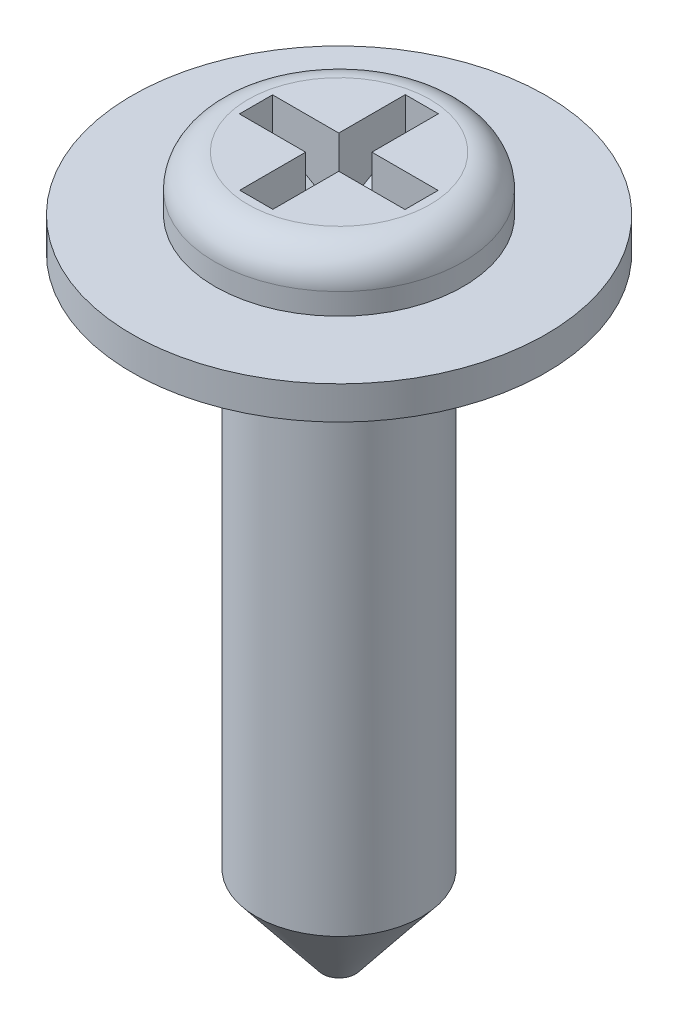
ISO-10303-21;
HEADER;
FILE_DESCRIPTION(('STEP AP214'),'2;1');
FILE_NAME('part.step','',(''),(''),'','','');
FILE_SCHEMA(('AUTOMOTIVE_DESIGN { 1 0 10303 214 1 1 1 1 }'));
ENDSEC;
DATA;
#1=APPLICATION_CONTEXT('core data for automotive mechanical design processes');
#2=APPLICATION_PROTOCOL_DEFINITION('international standard','automotive_design',2000,#1);
#3=PRODUCT_CONTEXT('',#1,'mechanical');
#4=PRODUCT('Part','Part','',(#3));
#5=PRODUCT_RELATED_PRODUCT_CATEGORY('part','',(#4));
#6=PRODUCT_DEFINITION_FORMATION('','',#4);
#7=PRODUCT_DEFINITION_CONTEXT('part definition',#1,'design');
#8=PRODUCT_DEFINITION('design','',#6,#7);
#9=PRODUCT_DEFINITION_SHAPE('','',#8);
#10=(LENGTH_UNIT() NAMED_UNIT(*) SI_UNIT(.MILLI.,.METRE.));
#11=(NAMED_UNIT(*) PLANE_ANGLE_UNIT() SI_UNIT($,.RADIAN.));
#12=(NAMED_UNIT(*) SI_UNIT($,.STERADIAN.) SOLID_ANGLE_UNIT());
#13=UNCERTAINTY_MEASURE_WITH_UNIT(LENGTH_MEASURE(1.E-05),#10,'distance_accuracy_value','');
#14=(GEOMETRIC_REPRESENTATION_CONTEXT(3) GLOBAL_UNCERTAINTY_ASSIGNED_CONTEXT((#13)) GLOBAL_UNIT_ASSIGNED_CONTEXT((#10,
#11,#12)) REPRESENTATION_CONTEXT('',''));
#15=CARTESIAN_POINT('',(0.,0.,0.));
#16=DIRECTION('',(0.,0.,1.));
#17=DIRECTION('',(1.,0.,0.));
#18=AXIS2_PLACEMENT_3D('',#15,#16,#17);
#19=CARTESIAN_POINT('',(0.,-8.5,0.));
#20=DIRECTION('',(0.,-1.,0.));
#21=DIRECTION('',(0.,0.,-1.));
#22=AXIS2_PLACEMENT_3D('',#19,#20,#21);
#23=CYLINDRICAL_SURFACE('',#22,2.5);
#24=CARTESIAN_POINT('',(0.,-0.658040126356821,0.));
#25=DIRECTION('',(0.,-1.,0.));
#26=DIRECTION('',(0.,0.,-1.));
#27=AXIS2_PLACEMENT_3D('',#24,#25,#26);
#28=CIRCLE('',#27,2.5);
#29=CARTESIAN_POINT('',(0.,-0.658040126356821,-2.5));
#30=VERTEX_POINT('',#29);
#31=EDGE_CURVE('E308',#30,#30,#28,.T.);
#32=ORIENTED_EDGE('',*,*,#31,.T.);
#33=EDGE_LOOP('',(#32));
#34=FACE_BOUND('',#33,.T.);
#35=CARTESIAN_POINT('',(0.,-1.05804012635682,0.));
#36=DIRECTION('',(0.,-1.,0.));
#37=DIRECTION('',(0.,0.,-1.));
#38=AXIS2_PLACEMENT_3D('',#35,#36,#37);
#39=CIRCLE('',#38,2.5);
#40=CARTESIAN_POINT('',(0.,-1.05804012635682,-2.5));
#41=VERTEX_POINT('',#40);
#42=EDGE_CURVE('E252',#41,#41,#39,.T.);
#43=ORIENTED_EDGE('',*,*,#42,.F.);
#44=EDGE_LOOP('',(#43));
#45=FACE_BOUND('',#44,.T.);
#46=ADVANCED_FACE('F39',(#34,#45),#23,.T.);
#47=CARTESIAN_POINT('',(1.5,-0.658040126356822,0.));
#48=DIRECTION('',(0.,1.,0.));
#49=DIRECTION('',(0.,0.,1.));
#50=AXIS2_PLACEMENT_3D('',#47,#48,#49);
#51=PLANE('',#50);
#52=CARTESIAN_POINT('',(0.,-0.658040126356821,0.));
#53=DIRECTION('',(0.,-1.,0.));
#54=DIRECTION('',(0.,0.,-1.));
#55=AXIS2_PLACEMENT_3D('',#52,#53,#54);
#56=CIRCLE('',#55,1.5);
#57=CARTESIAN_POINT('',(0.,-0.658040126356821,-1.5));
#58=VERTEX_POINT('',#57);
#59=EDGE_CURVE('E304',#58,#58,#56,.T.);
#60=ORIENTED_EDGE('',*,*,#59,.T.);
#61=EDGE_LOOP('',(#60));
#62=FACE_BOUND('',#61,.T.);
#63=ORIENTED_EDGE('',*,*,#31,.F.);
#64=EDGE_LOOP('',(#63));
#65=FACE_BOUND('',#64,.T.);
#66=ADVANCED_FACE('F412',(#62,#65),#51,.T.);
#67=CARTESIAN_POINT('',(0.,-8.5,0.));
#68=DIRECTION('',(0.,-1.,0.));
#69=DIRECTION('',(0.,0.,-1.));
#70=AXIS2_PLACEMENT_3D('',#67,#68,#69);
#71=CYLINDRICAL_SURFACE('',#70,1.5);
#72=CARTESIAN_POINT('',(0.,-0.399999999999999,0.));
#73=DIRECTION('',(0.,-1.,0.));
#74=DIRECTION('',(0.,0.,-1.));
#75=AXIS2_PLACEMENT_3D('',#72,#73,#74);
#76=CIRCLE('',#75,1.5);
#77=CARTESIAN_POINT('',(0.,-0.399999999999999,-1.5));
#78=VERTEX_POINT('',#77);
#79=EDGE_CURVE('E300',#78,#78,#76,.T.);
#80=ORIENTED_EDGE('',*,*,#79,.T.);
#81=EDGE_LOOP('',(#80));
#82=FACE_BOUND('',#81,.T.);
#83=ORIENTED_EDGE('',*,*,#59,.F.);
#84=EDGE_LOOP('',(#83));
#85=FACE_BOUND('',#84,.T.);
#86=ADVANCED_FACE('F418',(#82,#85),#71,.T.);
#87=CARTESIAN_POINT('',(0.,-0.4,0.));
#88=DIRECTION('',(0.,-1.,0.));
#89=DIRECTION('',(0.,0.,-1.));
#90=AXIS2_PLACEMENT_3D('',#87,#88,#89);
#91=TOROIDAL_SURFACE('',#90,1.1,0.4);
#92=CARTESIAN_POINT('',(0.,0.,0.));
#93=DIRECTION('',(0.,-1.,0.));
#94=DIRECTION('',(0.,0.,-1.));
#95=AXIS2_PLACEMENT_3D('',#92,#93,#94);
#96=CIRCLE('',#95,1.1);
#97=CARTESIAN_POINT('',(0.,0.,-1.1));
#98=VERTEX_POINT('',#97);
#99=EDGE_CURVE('E296',#98,#98,#96,.T.);
#100=ORIENTED_EDGE('',*,*,#99,.T.);
#101=EDGE_LOOP('',(#100));
#102=FACE_BOUND('',#101,.T.);
#103=ORIENTED_EDGE('',*,*,#79,.F.);
#104=EDGE_LOOP('',(#103));
#105=FACE_BOUND('',#104,.T.);
#106=ADVANCED_FACE('F586',(#102,#105),#91,.T.);
#107=CARTESIAN_POINT('',(0.,0.,0.));
#108=DIRECTION('',(0.,1.,0.));
#109=DIRECTION('',(0.,0.,1.));
#110=AXIS2_PLACEMENT_3D('',#107,#108,#109);
#111=PLANE('',#110);
#112=DIRECTION('',(0.,0.,1.));
#113=VECTOR('',#112,1.);
#114=CARTESIAN_POINT('',(-1.,0.,-0.196419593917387));
#115=LINE('',#114,#113);
#116=CARTESIAN_POINT('',(-1.,0.,-0.196419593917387));
#117=VERTEX_POINT('',#116);
#118=CARTESIAN_POINT('',(-1.,0.,0.203580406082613));
#119=VERTEX_POINT('',#118);
#120=EDGE_CURVE('E205',#117,#119,#115,.T.);
#121=ORIENTED_EDGE('',*,*,#120,.F.);
#122=DIRECTION('',(-1.,0.,0.));
#123=VECTOR('',#122,1.);
#124=CARTESIAN_POINT('',(-1.,0.,-0.196419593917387));
#125=LINE('',#124,#123);
#126=CARTESIAN_POINT('',(-0.2,0.,-0.196419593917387));
#127=VERTEX_POINT('',#126);
#128=EDGE_CURVE('E164',#127,#117,#125,.T.);
#129=ORIENTED_EDGE('',*,*,#128,.F.);
#130=DIRECTION('',(0.,0.,1.));
#131=VECTOR('',#130,1.);
#132=CARTESIAN_POINT('',(-0.2,0.,-1.));
#133=LINE('',#132,#131);
#134=CARTESIAN_POINT('',(-0.2,0.,-1.));
#135=VERTEX_POINT('',#134);
#136=EDGE_CURVE('E242',#135,#127,#133,.T.);
#137=ORIENTED_EDGE('',*,*,#136,.F.);
#138=DIRECTION('',(-1.,0.,0.));
#139=VECTOR('',#138,1.);
#140=CARTESIAN_POINT('',(-0.2,0.,-1.));
#141=LINE('',#140,#139);
#142=CARTESIAN_POINT('',(0.2,0.,-1.));
#143=VERTEX_POINT('',#142);
#144=EDGE_CURVE('E238',#143,#135,#141,.T.);
#145=ORIENTED_EDGE('',*,*,#144,.F.);
#146=DIRECTION('',(0.,0.,-1.));
#147=VECTOR('',#146,1.);
#148=CARTESIAN_POINT('',(0.2,0.,-1.));
#149=LINE('',#148,#147);
#150=CARTESIAN_POINT('',(0.2,0.,-0.196419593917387));
#151=VERTEX_POINT('',#150);
#152=EDGE_CURVE('E234',#151,#143,#149,.T.);
#153=ORIENTED_EDGE('',*,*,#152,.F.);
#154=DIRECTION('',(-1.,0.,0.));
#155=VECTOR('',#154,1.);
#156=CARTESIAN_POINT('',(0.2,0.,-0.196419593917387));
#157=LINE('',#156,#155);
#158=CARTESIAN_POINT('',(1.,0.,-0.196419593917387));
#159=VERTEX_POINT('',#158);
#160=EDGE_CURVE('E230',#159,#151,#157,.T.);
#161=ORIENTED_EDGE('',*,*,#160,.F.);
#162=DIRECTION('',(0.,0.,-1.));
#163=VECTOR('',#162,1.);
#164=CARTESIAN_POINT('',(1.,0.,-0.196419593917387));
#165=LINE('',#164,#163);
#166=CARTESIAN_POINT('',(1.,0.,0.203580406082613));
#167=VERTEX_POINT('',#166);
#168=EDGE_CURVE('E226',#167,#159,#165,.T.);
#169=ORIENTED_EDGE('',*,*,#168,.F.);
#170=DIRECTION('',(1.,0.,0.));
#171=VECTOR('',#170,1.);
#172=CARTESIAN_POINT('',(0.2,0.,0.203580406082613));
#173=LINE('',#172,#171);
#174=CARTESIAN_POINT('',(0.2,0.,0.203580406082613));
#175=VERTEX_POINT('',#174);
#176=EDGE_CURVE('E222',#175,#167,#173,.T.);
#177=ORIENTED_EDGE('',*,*,#176,.F.);
#178=DIRECTION('',(0.,0.,-1.));
#179=VECTOR('',#178,1.);
#180=CARTESIAN_POINT('',(0.2,0.,0.203580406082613));
#181=LINE('',#180,#179);
#182=CARTESIAN_POINT('',(0.2,0.,1.));
#183=VERTEX_POINT('',#182);
#184=EDGE_CURVE('E218',#183,#175,#181,.T.);
#185=ORIENTED_EDGE('',*,*,#184,.F.);
#186=DIRECTION('',(1.,0.,0.));
#187=VECTOR('',#186,1.);
#188=CARTESIAN_POINT('',(-0.2,0.,1.));
#189=LINE('',#188,#187);
#190=CARTESIAN_POINT('',(-0.2,0.,1.));
#191=VERTEX_POINT('',#190);
#192=EDGE_CURVE('E214',#191,#183,#189,.T.);
#193=ORIENTED_EDGE('',*,*,#192,.F.);
#194=DIRECTION('',(0.,0.,1.));
#195=VECTOR('',#194,1.);
#196=CARTESIAN_POINT('',(-0.2,0.,0.203580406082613));
#197=LINE('',#196,#195);
#198=CARTESIAN_POINT('',(-0.2,0.,0.203580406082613));
#199=VERTEX_POINT('',#198);
#200=EDGE_CURVE('E211',#199,#191,#197,.T.);
#201=ORIENTED_EDGE('',*,*,#200,.F.);
#202=DIRECTION('',(1.,0.,0.));
#203=VECTOR('',#202,1.);
#204=CARTESIAN_POINT('',(-1.,0.,0.203580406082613));
#205=LINE('',#204,#203);
#206=EDGE_CURVE('E170',#119,#199,#205,.T.);
#207=ORIENTED_EDGE('',*,*,#206,.F.);
#208=EDGE_LOOP('',(#121,#129,#137,#145,#153,#161,#169,#177,#185,#193,#201,#207));
#209=FACE_BOUND('',#208,.T.);
#210=ORIENTED_EDGE('',*,*,#99,.F.);
#211=EDGE_LOOP('',(#210));
#212=FACE_BOUND('',#211,.T.);
#213=ADVANCED_FACE('F376',(#209,#212),#111,.T.);
#214=CARTESIAN_POINT('',(0.200000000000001,-8.5,0.));
#215=DIRECTION('',(0.,-1.,0.));
#216=DIRECTION('',(0.,0.,-1.));
#217=AXIS2_PLACEMENT_3D('',#214,#215,#216);
#218=PLANE('',#217);
#219=CARTESIAN_POINT('',(0.,-8.5,0.));
#220=DIRECTION('',(0.,-1.,0.));
#221=DIRECTION('',(0.,0.,-1.));
#222=AXIS2_PLACEMENT_3D('',#219,#220,#221);
#223=CIRCLE('',#222,0.200000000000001);
#224=CARTESIAN_POINT('',(0.,-8.5,0.200000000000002));
#225=VERTEX_POINT('',#224);
#226=EDGE_CURVE('E292',#225,#225,#223,.T.);
#227=ORIENTED_EDGE('',*,*,#226,.T.);
#228=EDGE_LOOP('',(#227));
#229=FACE_BOUND('',#228,.T.);
#230=ADVANCED_FACE('F569',(#229),#218,.T.);
#231=CARTESIAN_POINT('',(0.,-8.5,0.));
#232=DIRECTION('',(0.,1.,0.));
#233=DIRECTION('',(0.,0.,1.));
#234=AXIS2_PLACEMENT_3D('',#231,#232,#233);
#235=CONICAL_SURFACE('',#234,0.200000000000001,0.674740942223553);
#236=CARTESIAN_POINT('',(0.,-7.5,0.));
#237=DIRECTION('',(0.,-1.,0.));
#238=DIRECTION('',(0.,0.,-1.));
#239=AXIS2_PLACEMENT_3D('',#236,#237,#238);
#240=CIRCLE('',#239,1.);
#241=CARTESIAN_POINT('',(0.,-7.5,1.));
#242=VERTEX_POINT('',#241);
#243=EDGE_CURVE('E288',#242,#242,#240,.T.);
#244=CARTESIAN_POINT('',(0.,-7.5,1.));
#245=CARTESIAN_POINT('',(0.,-7.51041666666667,0.991666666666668));
#246=CARTESIAN_POINT('',(0.,-7.52083333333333,0.983333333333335));
#247=CARTESIAN_POINT('',(0.,-7.54166666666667,0.966666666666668));
#248=CARTESIAN_POINT('',(0.,-7.55208333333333,0.958333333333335));
#249=CARTESIAN_POINT('',(0.,-7.57291666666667,0.941666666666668));
#250=CARTESIAN_POINT('',(0.,-7.58333333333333,0.933333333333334));
#251=CARTESIAN_POINT('',(0.,-7.60416666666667,0.916666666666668));
#252=CARTESIAN_POINT('',(0.,-7.61458333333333,0.908333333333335));
#253=CARTESIAN_POINT('',(0.,-7.63541666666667,0.891666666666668));
#254=CARTESIAN_POINT('',(0.,-7.64583333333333,0.883333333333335));
#255=CARTESIAN_POINT('',(0.,-7.66666666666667,0.866666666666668));
#256=CARTESIAN_POINT('',(0.,-7.67708333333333,0.858333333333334));
#257=CARTESIAN_POINT('',(0.,-7.69791666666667,0.841666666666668));
#258=CARTESIAN_POINT('',(0.,-7.70833333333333,0.833333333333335));
#259=CARTESIAN_POINT('',(0.,-7.72916666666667,0.816666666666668));
#260=CARTESIAN_POINT('',(0.,-7.73958333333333,0.808333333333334));
#261=CARTESIAN_POINT('',(0.,-7.76041666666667,0.791666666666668));
#262=CARTESIAN_POINT('',(0.,-7.77083333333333,0.783333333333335));
#263=CARTESIAN_POINT('',(0.,-7.79166666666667,0.766666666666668));
#264=CARTESIAN_POINT('',(0.,-7.80208333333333,0.758333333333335));
#265=CARTESIAN_POINT('',(0.,-7.82291666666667,0.741666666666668));
#266=CARTESIAN_POINT('',(0.,-7.83333333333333,0.733333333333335));
#267=CARTESIAN_POINT('',(0.,-7.85416666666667,0.716666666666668));
#268=CARTESIAN_POINT('',(0.,-7.86458333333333,0.708333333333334));
#269=CARTESIAN_POINT('',(0.,-7.88541666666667,0.691666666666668));
#270=CARTESIAN_POINT('',(0.,-7.89583333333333,0.683333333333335));
#271=CARTESIAN_POINT('',(0.,-7.91666666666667,0.666666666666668));
#272=CARTESIAN_POINT('',(0.,-7.92708333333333,0.658333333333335));
#273=CARTESIAN_POINT('',(0.,-7.94791666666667,0.641666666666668));
#274=CARTESIAN_POINT('',(0.,-7.95833333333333,0.633333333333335));
#275=CARTESIAN_POINT('',(0.,-7.97916666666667,0.616666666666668));
#276=CARTESIAN_POINT('',(0.,-7.98958333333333,0.608333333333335));
#277=CARTESIAN_POINT('',(0.,-8.01041666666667,0.591666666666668));
#278=CARTESIAN_POINT('',(0.,-8.02083333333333,0.583333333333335));
#279=CARTESIAN_POINT('',(0.,-8.04166666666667,0.566666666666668));
#280=CARTESIAN_POINT('',(0.,-8.05208333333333,0.558333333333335));
#281=CARTESIAN_POINT('',(0.,-8.07291666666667,0.541666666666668));
#282=CARTESIAN_POINT('',(0.,-8.08333333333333,0.533333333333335));
#283=CARTESIAN_POINT('',(0.,-8.10416666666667,0.516666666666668));
#284=CARTESIAN_POINT('',(0.,-8.11458333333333,0.508333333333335));
#285=CARTESIAN_POINT('',(0.,-8.13541666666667,0.491666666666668));
#286=CARTESIAN_POINT('',(0.,-8.14583333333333,0.483333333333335));
#287=CARTESIAN_POINT('',(0.,-8.16666666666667,0.466666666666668));
#288=CARTESIAN_POINT('',(0.,-8.17708333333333,0.458333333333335));
#289=CARTESIAN_POINT('',(0.,-8.19791666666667,0.441666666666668));
#290=CARTESIAN_POINT('',(0.,-8.20833333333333,0.433333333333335));
#291=CARTESIAN_POINT('',(0.,-8.22916666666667,0.416666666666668));
#292=CARTESIAN_POINT('',(0.,-8.23958333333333,0.408333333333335));
#293=CARTESIAN_POINT('',(0.,-8.26041666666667,0.391666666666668));
#294=CARTESIAN_POINT('',(0.,-8.27083333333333,0.383333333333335));
#295=CARTESIAN_POINT('',(0.,-8.29166666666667,0.366666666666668));
#296=CARTESIAN_POINT('',(0.,-8.30208333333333,0.358333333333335));
#297=CARTESIAN_POINT('',(0.,-8.32291666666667,0.341666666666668));
#298=CARTESIAN_POINT('',(0.,-8.33333333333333,0.333333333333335));
#299=CARTESIAN_POINT('',(0.,-8.35416666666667,0.316666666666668));
#300=CARTESIAN_POINT('',(0.,-8.36458333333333,0.308333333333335));
#301=CARTESIAN_POINT('',(0.,-8.38541666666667,0.291666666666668));
#302=CARTESIAN_POINT('',(0.,-8.39583333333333,0.283333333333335));
#303=CARTESIAN_POINT('',(0.,-8.41666666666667,0.266666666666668));
#304=CARTESIAN_POINT('',(0.,-8.42708333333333,0.258333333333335));
#305=CARTESIAN_POINT('',(0.,-8.44791666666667,0.241666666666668));
#306=CARTESIAN_POINT('',(0.,-8.45833333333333,0.233333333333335));
#307=CARTESIAN_POINT('',(0.,-8.47916666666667,0.216666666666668));
#308=CARTESIAN_POINT('',(0.,-8.48958333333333,0.208333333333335));
#309=CARTESIAN_POINT('',(0.,-8.5,0.200000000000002));
#310=B_SPLINE_CURVE_WITH_KNOTS('',3,(#244,#245,#246,#247,#248,#249,#250,#251,#252,#253,#254,
#255,#256,#257,#258,#259,#260,#261,#262,#263,#264,#265,#266,#267,#268,#269,#270,#271,#272,#273,
#274,#275,#276,#277,#278,#279,#280,#281,#282,#283,#284,#285,#286,#287,#288,#289,#290,#291,#292,
#293,#294,#295,#296,#297,#298,#299,#300,#301,#302,#303,#304,#305,#306,#307,#308,#309),
.UNSPECIFIED.,.F.,.F.,(4,2,2,2,2,2,2,2,2,2,2,2,2,2,2,2,2,2,2,2,2,2,2,2,2,2,2,2,2,2,2,2,4),(0.,
0.0400195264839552,0.0800390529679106,0.120058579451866,0.160078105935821,0.200097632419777,
0.240117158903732,0.280136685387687,0.320156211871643,0.360175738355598,0.400195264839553,
0.440214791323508,0.480234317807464,0.520253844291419,0.560273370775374,0.60029289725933,
0.640312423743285,0.68033195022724,0.720351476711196,0.760371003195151,0.800390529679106,
0.840410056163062,0.880429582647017,0.920449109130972,0.960468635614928,1.00048816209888,
1.04050768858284,1.08052721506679,1.12054674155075,1.1605662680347,1.20058579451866,
1.24060532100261,1.28062484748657),.UNSPECIFIED.);
#311=EDGE_CURVE('BSEAM560',#242,#225,#310,.T.);
#312=ORIENTED_EDGE('',*,*,#243,.T.);
#313=ORIENTED_EDGE('',*,*,#226,.F.);
#314=ORIENTED_EDGE('',*,*,#311,.T.);
#315=ORIENTED_EDGE('',*,*,#311,.F.);
#316=EDGE_LOOP('',(#312,#314,#313,#315));
#317=FACE_BOUND('',#316,.T.);
#318=ADVANCED_FACE('F560',(#317),#235,.T.);
#319=CARTESIAN_POINT('',(0.,-8.5,0.));
#320=DIRECTION('',(0.,-1.,0.));
#321=DIRECTION('',(0.,0.,-1.));
#322=AXIS2_PLACEMENT_3D('',#319,#320,#321);
#323=CYLINDRICAL_SURFACE('',#322,1.);
#324=CARTESIAN_POINT('',(0.,-1.05804012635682,0.));
#325=DIRECTION('',(0.,-1.,0.));
#326=DIRECTION('',(0.,0.,-1.));
#327=AXIS2_PLACEMENT_3D('',#324,#325,#326);
#328=CIRCLE('',#327,1.);
#329=CARTESIAN_POINT('',(0.,-1.05804012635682,-1.));
#330=VERTEX_POINT('',#329);
#331=EDGE_CURVE('E284',#330,#330,#328,.T.);
#332=ORIENTED_EDGE('',*,*,#331,.T.);
#333=EDGE_LOOP('',(#332));
#334=FACE_BOUND('',#333,.T.);
#335=ORIENTED_EDGE('',*,*,#243,.F.);
#336=EDGE_LOOP('',(#335));
#337=FACE_BOUND('',#336,.T.);
#338=ADVANCED_FACE('F551',(#334,#337),#323,.T.);
#339=CARTESIAN_POINT('',(1.,-1.05804012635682,0.));
#340=DIRECTION('',(0.,-1.,0.));
#341=DIRECTION('',(0.,0.,-1.));
#342=AXIS2_PLACEMENT_3D('',#339,#340,#341);
#343=PLANE('',#342);
#344=ORIENTED_EDGE('',*,*,#42,.T.);
#345=EDGE_LOOP('',(#344));
#346=FACE_BOUND('',#345,.T.);
#347=ORIENTED_EDGE('',*,*,#331,.F.);
#348=EDGE_LOOP('',(#347));
#349=FACE_BOUND('',#348,.T.);
#350=ADVANCED_FACE('F542',(#346,#349),#343,.T.);
#351=CARTESIAN_POINT('',(-1.,-0.8,-0.196419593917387));
#352=DIRECTION('',(-1.,0.,0.));
#353=DIRECTION('',(0.,0.,1.));
#354=AXIS2_PLACEMENT_3D('',#351,#352,#353);
#355=PLANE('',#354);
#356=DIRECTION('',(0.,1.,0.));
#357=VECTOR('',#356,1.);
#358=CARTESIAN_POINT('',(-1.,-0.8,0.203580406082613));
#359=LINE('',#358,#357);
#360=CARTESIAN_POINT('',(-1.,-0.4,0.203580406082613));
#361=VERTEX_POINT('',#360);
#362=EDGE_CURVE('E176',#361,#119,#359,.T.);
#363=ORIENTED_EDGE('',*,*,#362,.F.);
#364=DIRECTION('',(0.,0.,-1.));
#365=VECTOR('',#364,1.);
#366=CARTESIAN_POINT('',(-1.,-0.4,-0.196419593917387));
#367=LINE('',#366,#365);
#368=CARTESIAN_POINT('',(-1.,-0.4,-0.196419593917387));
#369=VERTEX_POINT('',#368);
#370=EDGE_CURVE('E328',#361,#369,#367,.T.);
#371=ORIENTED_EDGE('',*,*,#370,.T.);
#372=DIRECTION('',(0.,1.,0.));
#373=VECTOR('',#372,1.);
#374=CARTESIAN_POINT('',(-1.,-0.8,-0.196419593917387));
#375=LINE('',#374,#373);
#376=EDGE_CURVE('E249',#369,#117,#375,.T.);
#377=ORIENTED_EDGE('',*,*,#376,.T.);
#378=ORIENTED_EDGE('',*,*,#120,.T.);
#379=EDGE_LOOP('',(#363,#371,#377,#378));
#380=FACE_BOUND('',#379,.T.);
#381=ADVANCED_FACE('F388',(#380),#355,.F.);
#382=CARTESIAN_POINT('',(-1.,-0.8,-0.196419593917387));
#383=DIRECTION('',(0.,0.,-1.));
#384=DIRECTION('',(-1.,0.,0.));
#385=AXIS2_PLACEMENT_3D('',#382,#383,#384);
#386=PLANE('',#385);
#387=ORIENTED_EDGE('',*,*,#376,.F.);
#388=DIRECTION('',(0.866025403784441,-0.499999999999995,0.));
#389=VECTOR('',#388,1.);
#390=CARTESIAN_POINT('',(-0.30717967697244,-0.8,-0.196419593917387));
#391=LINE('',#390,#389);
#392=CARTESIAN_POINT('',(-0.30717967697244,-0.8,-0.196419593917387));
#393=VERTEX_POINT('',#392);
#394=EDGE_CURVE('E331',#369,#393,#391,.T.);
#395=ORIENTED_EDGE('',*,*,#394,.T.);
#396=DIRECTION('',(-1.,0.,0.));
#397=VECTOR('',#396,1.);
#398=CARTESIAN_POINT('',(-1.,-0.8,-0.196419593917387));
#399=LINE('',#398,#397);
#400=CARTESIAN_POINT('',(-0.2,-0.8,-0.196419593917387));
#401=VERTEX_POINT('',#400);
#402=EDGE_CURVE('E202',#401,#393,#399,.T.);
#403=ORIENTED_EDGE('',*,*,#402,.F.);
#404=DIRECTION('',(0.,1.,0.));
#405=VECTOR('',#404,1.);
#406=CARTESIAN_POINT('',(-0.2,-0.8,-0.196419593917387));
#407=LINE('',#406,#405);
#408=EDGE_CURVE('E253',#401,#127,#407,.T.);
#409=ORIENTED_EDGE('',*,*,#408,.T.);
#410=ORIENTED_EDGE('',*,*,#128,.T.);
#411=EDGE_LOOP('',(#387,#395,#403,#409,#410));
#412=FACE_BOUND('',#411,.T.);
#413=ADVANCED_FACE('F381',(#412),#386,.F.);
#414=CARTESIAN_POINT('',(-0.2,-0.8,-1.));
#415=DIRECTION('',(-1.,0.,0.));
#416=DIRECTION('',(0.,0.,1.));
#417=AXIS2_PLACEMENT_3D('',#414,#415,#416);
#418=PLANE('',#417);
#419=DIRECTION('',(0.,0.,1.));
#420=VECTOR('',#419,1.);
#421=CARTESIAN_POINT('',(-0.2,-0.8,-1.));
#422=LINE('',#421,#420);
#423=CARTESIAN_POINT('',(-0.2,-0.8,-0.30717967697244));
#424=VERTEX_POINT('',#423);
#425=EDGE_CURVE('E199',#424,#401,#422,.T.);
#426=ORIENTED_EDGE('',*,*,#425,.F.);
#427=DIRECTION('',(0.,0.499999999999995,-0.866025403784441));
#428=VECTOR('',#427,1.);
#429=CARTESIAN_POINT('',(-0.2,-0.8,-0.30717967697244));
#430=LINE('',#429,#428);
#431=CARTESIAN_POINT('',(-0.2,-0.4,-1.));
#432=VERTEX_POINT('',#431);
#433=EDGE_CURVE('E342',#424,#432,#430,.T.);
#434=ORIENTED_EDGE('',*,*,#433,.T.);
#435=DIRECTION('',(0.,1.,0.));
#436=VECTOR('',#435,1.);
#437=CARTESIAN_POINT('',(-0.2,-0.8,-1.));
#438=LINE('',#437,#436);
#439=EDGE_CURVE('E256',#432,#135,#438,.T.);
#440=ORIENTED_EDGE('',*,*,#439,.T.);
#441=ORIENTED_EDGE('',*,*,#136,.T.);
#442=ORIENTED_EDGE('',*,*,#408,.F.);
#443=EDGE_LOOP('',(#426,#434,#440,#441,#442));
#444=FACE_BOUND('',#443,.T.);
#445=ADVANCED_FACE('F366',(#444),#418,.F.);
#446=CARTESIAN_POINT('',(-0.2,-0.8,-1.));
#447=DIRECTION('',(0.,0.,-1.));
#448=DIRECTION('',(-1.,0.,0.));
#449=AXIS2_PLACEMENT_3D('',#446,#447,#448);
#450=PLANE('',#449);
#451=ORIENTED_EDGE('',*,*,#439,.F.);
#452=DIRECTION('',(1.,0.,0.));
#453=VECTOR('',#452,1.);
#454=CARTESIAN_POINT('',(-0.2,-0.4,-1.));
#455=LINE('',#454,#453);
#456=CARTESIAN_POINT('',(0.2,-0.4,-1.));
#457=VERTEX_POINT('',#456);
#458=EDGE_CURVE('E345',#432,#457,#455,.T.);
#459=ORIENTED_EDGE('',*,*,#458,.T.);
#460=DIRECTION('',(0.,1.,0.));
#461=VECTOR('',#460,1.);
#462=CARTESIAN_POINT('',(0.2,-0.8,-1.));
#463=LINE('',#462,#461);
#464=EDGE_CURVE('E259',#457,#143,#463,.T.);
#465=ORIENTED_EDGE('',*,*,#464,.T.);
#466=ORIENTED_EDGE('',*,*,#144,.T.);
#467=EDGE_LOOP('',(#451,#459,#465,#466));
#468=FACE_BOUND('',#467,.T.);
#469=ADVANCED_FACE('F369',(#468),#450,.F.);
#470=CARTESIAN_POINT('',(0.2,-0.8,-1.));
#471=DIRECTION('',(1.,0.,0.));
#472=DIRECTION('',(0.,0.,-1.));
#473=AXIS2_PLACEMENT_3D('',#470,#471,#472);
#474=PLANE('',#473);
#475=ORIENTED_EDGE('',*,*,#464,.F.);
#476=DIRECTION('',(0.,-0.499999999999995,0.866025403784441));
#477=VECTOR('',#476,1.);
#478=CARTESIAN_POINT('',(0.2,-0.8,-0.30717967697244));
#479=LINE('',#478,#477);
#480=CARTESIAN_POINT('',(0.2,-0.8,-0.30717967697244));
#481=VERTEX_POINT('',#480);
#482=EDGE_CURVE('E348',#457,#481,#479,.T.);
#483=ORIENTED_EDGE('',*,*,#482,.T.);
#484=DIRECTION('',(0.,0.,-1.));
#485=VECTOR('',#484,1.);
#486=CARTESIAN_POINT('',(0.2,-0.8,-1.));
#487=LINE('',#486,#485);
#488=CARTESIAN_POINT('',(0.2,-0.8,-0.196419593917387));
#489=VERTEX_POINT('',#488);
#490=EDGE_CURVE('E195',#489,#481,#487,.T.);
#491=ORIENTED_EDGE('',*,*,#490,.F.);
#492=DIRECTION('',(0.,1.,0.));
#493=VECTOR('',#492,1.);
#494=CARTESIAN_POINT('',(0.2,-0.8,-0.196419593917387));
#495=LINE('',#494,#493);
#496=EDGE_CURVE('E262',#489,#151,#495,.T.);
#497=ORIENTED_EDGE('',*,*,#496,.T.);
#498=ORIENTED_EDGE('',*,*,#152,.T.);
#499=EDGE_LOOP('',(#475,#483,#491,#497,#498));
#500=FACE_BOUND('',#499,.T.);
#501=ADVANCED_FACE('F357',(#500),#474,.F.);
#502=CARTESIAN_POINT('',(0.2,-0.8,-0.196419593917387));
#503=DIRECTION('',(0.,0.,-1.));
#504=DIRECTION('',(-1.,0.,0.));
#505=AXIS2_PLACEMENT_3D('',#502,#503,#504);
#506=PLANE('',#505);
#507=DIRECTION('',(-1.,0.,0.));
#508=VECTOR('',#507,1.);
#509=CARTESIAN_POINT('',(0.2,-0.8,-0.196419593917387));
#510=LINE('',#509,#508);
#511=CARTESIAN_POINT('',(0.30717967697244,-0.8,-0.196419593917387));
#512=VERTEX_POINT('',#511);
#513=EDGE_CURVE('E192',#512,#489,#510,.T.);
#514=ORIENTED_EDGE('',*,*,#513,.F.);
#515=DIRECTION('',(0.866025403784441,0.499999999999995,0.));
#516=VECTOR('',#515,1.);
#517=CARTESIAN_POINT('',(0.30717967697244,-0.8,-0.196419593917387));
#518=LINE('',#517,#516);
#519=CARTESIAN_POINT('',(1.,-0.4,-0.196419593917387));
#520=VERTEX_POINT('',#519);
#521=EDGE_CURVE('E62',#512,#520,#518,.T.);
#522=ORIENTED_EDGE('',*,*,#521,.T.);
#523=DIRECTION('',(0.,1.,0.));
#524=VECTOR('',#523,1.);
#525=CARTESIAN_POINT('',(1.,-0.8,-0.196419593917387));
#526=LINE('',#525,#524);
#527=EDGE_CURVE('E265',#520,#159,#526,.T.);
#528=ORIENTED_EDGE('',*,*,#527,.T.);
#529=ORIENTED_EDGE('',*,*,#160,.T.);
#530=ORIENTED_EDGE('',*,*,#496,.F.);
#531=EDGE_LOOP('',(#514,#522,#528,#529,#530));
#532=FACE_BOUND('',#531,.T.);
#533=ADVANCED_FACE('F499',(#532),#506,.F.);
#534=CARTESIAN_POINT('',(1.,-0.8,-0.196419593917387));
#535=DIRECTION('',(1.,0.,0.));
#536=DIRECTION('',(0.,0.,-1.));
#537=AXIS2_PLACEMENT_3D('',#534,#535,#536);
#538=PLANE('',#537);
#539=ORIENTED_EDGE('',*,*,#527,.F.);
#540=DIRECTION('',(0.,0.,1.));
#541=VECTOR('',#540,1.);
#542=CARTESIAN_POINT('',(1.,-0.4,-0.196419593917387));
#543=LINE('',#542,#541);
#544=CARTESIAN_POINT('',(1.,-0.4,0.203580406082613));
#545=VERTEX_POINT('',#544);
#546=EDGE_CURVE('E48',#520,#545,#543,.T.);
#547=ORIENTED_EDGE('',*,*,#546,.T.);
#548=DIRECTION('',(0.,1.,0.));
#549=VECTOR('',#548,1.);
#550=CARTESIAN_POINT('',(1.,-0.8,0.203580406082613));
#551=LINE('',#550,#549);
#552=EDGE_CURVE('E268',#545,#167,#551,.T.);
#553=ORIENTED_EDGE('',*,*,#552,.T.);
#554=ORIENTED_EDGE('',*,*,#168,.T.);
#555=EDGE_LOOP('',(#539,#547,#553,#554));
#556=FACE_BOUND('',#555,.T.);
#557=ADVANCED_FACE('F491',(#556),#538,.F.);
#558=CARTESIAN_POINT('',(0.2,-0.8,0.203580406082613));
#559=DIRECTION('',(0.,0.,1.));
#560=DIRECTION('',(1.,0.,0.));
#561=AXIS2_PLACEMENT_3D('',#558,#559,#560);
#562=PLANE('',#561);
#563=ORIENTED_EDGE('',*,*,#552,.F.);
#564=DIRECTION('',(-0.866025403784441,-0.499999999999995,0.));
#565=VECTOR('',#564,1.);
#566=CARTESIAN_POINT('',(0.30717967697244,-0.8,0.203580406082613));
#567=LINE('',#566,#565);
#568=CARTESIAN_POINT('',(0.30717967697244,-0.8,0.203580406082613));
#569=VERTEX_POINT('',#568);
#570=EDGE_CURVE('E11',#545,#569,#567,.T.);
#571=ORIENTED_EDGE('',*,*,#570,.T.);
#572=DIRECTION('',(1.,0.,0.));
#573=VECTOR('',#572,1.);
#574=CARTESIAN_POINT('',(0.2,-0.8,0.203580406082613));
#575=LINE('',#574,#573);
#576=CARTESIAN_POINT('',(0.2,-0.8,0.203580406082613));
#577=VERTEX_POINT('',#576);
#578=EDGE_CURVE('E186',#577,#569,#575,.T.);
#579=ORIENTED_EDGE('',*,*,#578,.F.);
#580=DIRECTION('',(0.,1.,0.));
#581=VECTOR('',#580,1.);
#582=CARTESIAN_POINT('',(0.2,-0.8,0.203580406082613));
#583=LINE('',#582,#581);
#584=EDGE_CURVE('E271',#577,#175,#583,.T.);
#585=ORIENTED_EDGE('',*,*,#584,.T.);
#586=ORIENTED_EDGE('',*,*,#176,.T.);
#587=EDGE_LOOP('',(#563,#571,#579,#585,#586));
#588=FACE_BOUND('',#587,.T.);
#589=ADVANCED_FACE('F403',(#588),#562,.F.);
#590=CARTESIAN_POINT('',(0.2,-0.8,0.203580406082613));
#591=DIRECTION('',(1.,0.,0.));
#592=DIRECTION('',(0.,0.,-1.));
#593=AXIS2_PLACEMENT_3D('',#590,#591,#592);
#594=PLANE('',#593);
#595=DIRECTION('',(0.,0.,-1.));
#596=VECTOR('',#595,1.);
#597=CARTESIAN_POINT('',(0.2,-0.8,0.203580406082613));
#598=LINE('',#597,#596);
#599=CARTESIAN_POINT('',(0.2,-0.8,0.30717967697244));
#600=VERTEX_POINT('',#599);
#601=EDGE_CURVE('E183',#600,#577,#598,.T.);
#602=ORIENTED_EDGE('',*,*,#601,.F.);
#603=DIRECTION('',(0.,0.499999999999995,0.866025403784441));
#604=VECTOR('',#603,1.);
#605=CARTESIAN_POINT('',(0.2,-0.8,0.30717967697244));
#606=LINE('',#605,#604);
#607=CARTESIAN_POINT('',(0.2,-0.4,1.));
#608=VERTEX_POINT('',#607);
#609=EDGE_CURVE('E334',#600,#608,#606,.T.);
#610=ORIENTED_EDGE('',*,*,#609,.T.);
#611=DIRECTION('',(0.,1.,0.));
#612=VECTOR('',#611,1.);
#613=CARTESIAN_POINT('',(0.2,-0.8,1.));
#614=LINE('',#613,#612);
#615=EDGE_CURVE('E274',#608,#183,#614,.T.);
#616=ORIENTED_EDGE('',*,*,#615,.T.);
#617=ORIENTED_EDGE('',*,*,#184,.T.);
#618=ORIENTED_EDGE('',*,*,#584,.F.);
#619=EDGE_LOOP('',(#602,#610,#616,#617,#618));
#620=FACE_BOUND('',#619,.T.);
#621=ADVANCED_FACE('F398',(#620),#594,.F.);
#622=CARTESIAN_POINT('',(-0.2,-0.8,1.));
#623=DIRECTION('',(0.,0.,1.));
#624=DIRECTION('',(1.,0.,0.));
#625=AXIS2_PLACEMENT_3D('',#622,#623,#624);
#626=PLANE('',#625);
#627=ORIENTED_EDGE('',*,*,#615,.F.);
#628=DIRECTION('',(-1.,0.,0.));
#629=VECTOR('',#628,1.);
#630=CARTESIAN_POINT('',(-0.2,-0.4,1.));
#631=LINE('',#630,#629);
#632=CARTESIAN_POINT('',(-0.2,-0.4,1.));
#633=VERTEX_POINT('',#632);
#634=EDGE_CURVE('E337',#608,#633,#631,.T.);
#635=ORIENTED_EDGE('',*,*,#634,.T.);
#636=DIRECTION('',(0.,1.,0.));
#637=VECTOR('',#636,1.);
#638=CARTESIAN_POINT('',(-0.2,-0.8,1.));
#639=LINE('',#638,#637);
#640=EDGE_CURVE('E175',#633,#191,#639,.T.);
#641=ORIENTED_EDGE('',*,*,#640,.T.);
#642=ORIENTED_EDGE('',*,*,#192,.T.);
#643=EDGE_LOOP('',(#627,#635,#641,#642));
#644=FACE_BOUND('',#643,.T.);
#645=ADVANCED_FACE('F469',(#644),#626,.F.);
#646=CARTESIAN_POINT('',(-0.2,-0.8,0.203580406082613));
#647=DIRECTION('',(-1.,0.,0.));
#648=DIRECTION('',(0.,0.,1.));
#649=AXIS2_PLACEMENT_3D('',#646,#647,#648);
#650=PLANE('',#649);
#651=ORIENTED_EDGE('',*,*,#640,.F.);
#652=DIRECTION('',(0.,-0.499999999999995,-0.866025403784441));
#653=VECTOR('',#652,1.);
#654=CARTESIAN_POINT('',(-0.2,-0.8,0.30717967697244));
#655=LINE('',#654,#653);
#656=CARTESIAN_POINT('',(-0.2,-0.8,0.30717967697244));
#657=VERTEX_POINT('',#656);
#658=EDGE_CURVE('E181',#633,#657,#655,.T.);
#659=ORIENTED_EDGE('',*,*,#658,.T.);
#660=DIRECTION('',(0.,0.,1.));
#661=VECTOR('',#660,1.);
#662=CARTESIAN_POINT('',(-0.2,-0.8,0.203580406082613));
#663=LINE('',#662,#661);
#664=CARTESIAN_POINT('',(-0.2,-0.8,0.203580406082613));
#665=VERTEX_POINT('',#664);
#666=EDGE_CURVE('E158',#665,#657,#663,.T.);
#667=ORIENTED_EDGE('',*,*,#666,.F.);
#668=DIRECTION('',(0.,1.,0.));
#669=VECTOR('',#668,1.);
#670=CARTESIAN_POINT('',(-0.2,-0.8,0.203580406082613));
#671=LINE('',#670,#669);
#672=EDGE_CURVE('E167',#665,#199,#671,.T.);
#673=ORIENTED_EDGE('',*,*,#672,.T.);
#674=ORIENTED_EDGE('',*,*,#200,.T.);
#675=EDGE_LOOP('',(#651,#659,#667,#673,#674));
#676=FACE_BOUND('',#675,.T.);
#677=ADVANCED_FACE('F179',(#676),#650,.F.);
#678=CARTESIAN_POINT('',(-1.,-0.8,0.203580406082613));
#679=DIRECTION('',(0.,0.,1.));
#680=DIRECTION('',(1.,0.,0.));
#681=AXIS2_PLACEMENT_3D('',#678,#679,#680);
#682=PLANE('',#681);
#683=DIRECTION('',(1.,0.,0.));
#684=VECTOR('',#683,1.);
#685=CARTESIAN_POINT('',(-1.,-0.8,0.203580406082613));
#686=LINE('',#685,#684);
#687=CARTESIAN_POINT('',(-0.30717967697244,-0.8,0.203580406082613));
#688=VERTEX_POINT('',#687);
#689=EDGE_CURVE('E152',#688,#665,#686,.T.);
#690=ORIENTED_EDGE('',*,*,#689,.F.);
#691=DIRECTION('',(-0.866025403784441,0.499999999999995,0.));
#692=VECTOR('',#691,1.);
#693=CARTESIAN_POINT('',(-0.30717967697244,-0.8,0.203580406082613));
#694=LINE('',#693,#692);
#695=EDGE_CURVE('E325',#688,#361,#694,.T.);
#696=ORIENTED_EDGE('',*,*,#695,.T.);
#697=ORIENTED_EDGE('',*,*,#362,.T.);
#698=ORIENTED_EDGE('',*,*,#206,.T.);
#699=ORIENTED_EDGE('',*,*,#672,.F.);
#700=EDGE_LOOP('',(#690,#696,#697,#698,#699));
#701=FACE_BOUND('',#700,.T.);
#702=ADVANCED_FACE('F168',(#701),#682,.F.);
#703=CARTESIAN_POINT('',(0.,-0.8,0.));
#704=DIRECTION('',(0.,1.,0.));
#705=DIRECTION('',(0.,0.,1.));
#706=AXIS2_PLACEMENT_3D('',#703,#704,#705);
#707=PLANE('',#706);
#708=ORIENTED_EDGE('',*,*,#402,.T.);
#709=DIRECTION('',(0.,0.,1.));
#710=VECTOR('',#709,1.);
#711=CARTESIAN_POINT('',(-0.30717967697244,-0.8,0.));
#712=LINE('',#711,#710);
#713=EDGE_CURVE('E161',#393,#688,#712,.T.);
#714=ORIENTED_EDGE('',*,*,#713,.T.);
#715=ORIENTED_EDGE('',*,*,#689,.T.);
#716=ORIENTED_EDGE('',*,*,#666,.T.);
#717=DIRECTION('',(1.,0.,0.));
#718=VECTOR('',#717,1.);
#719=CARTESIAN_POINT('',(0.,-0.8,0.30717967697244));
#720=LINE('',#719,#718);
#721=EDGE_CURVE('E320',#657,#600,#720,.T.);
#722=ORIENTED_EDGE('',*,*,#721,.T.);
#723=ORIENTED_EDGE('',*,*,#601,.T.);
#724=ORIENTED_EDGE('',*,*,#578,.T.);
#725=DIRECTION('',(0.,0.,-1.));
#726=VECTOR('',#725,1.);
#727=CARTESIAN_POINT('',(0.30717967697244,-0.8,0.));
#728=LINE('',#727,#726);
#729=EDGE_CURVE('E312',#569,#512,#728,.T.);
#730=ORIENTED_EDGE('',*,*,#729,.T.);
#731=ORIENTED_EDGE('',*,*,#513,.T.);
#732=ORIENTED_EDGE('',*,*,#490,.T.);
#733=DIRECTION('',(-1.,0.,0.));
#734=VECTOR('',#733,1.);
#735=CARTESIAN_POINT('',(0.,-0.8,-0.30717967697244));
#736=LINE('',#735,#734);
#737=EDGE_CURVE('E316',#481,#424,#736,.T.);
#738=ORIENTED_EDGE('',*,*,#737,.T.);
#739=ORIENTED_EDGE('',*,*,#425,.T.);
#740=EDGE_LOOP('',(#708,#714,#715,#716,#722,#723,#724,#730,#731,#732,#738,#739));
#741=FACE_BOUND('',#740,.T.);
#742=ADVANCED_FACE('F155',(#741),#707,.T.);
#743=CARTESIAN_POINT('',(-0.30717967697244,-0.8,0.));
#744=DIRECTION('',(-0.499999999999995,-0.866025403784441,0.));
#745=DIRECTION('',(0.,0.,1.));
#746=AXIS2_PLACEMENT_3D('',#743,#744,#745);
#747=PLANE('',#746);
#748=ORIENTED_EDGE('',*,*,#394,.F.);
#749=ORIENTED_EDGE('',*,*,#370,.F.);
#750=ORIENTED_EDGE('',*,*,#695,.F.);
#751=ORIENTED_EDGE('',*,*,#713,.F.);
#752=EDGE_LOOP('',(#748,#749,#750,#751));
#753=FACE_BOUND('',#752,.T.);
#754=ADVANCED_FACE('F384',(#753),#747,.F.);
#755=CARTESIAN_POINT('',(0.,-0.8,0.30717967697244));
#756=DIRECTION('',(0.,-0.866025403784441,0.499999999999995));
#757=DIRECTION('',(1.,0.,0.));
#758=AXIS2_PLACEMENT_3D('',#755,#756,#757);
#759=PLANE('',#758);
#760=ORIENTED_EDGE('',*,*,#658,.F.);
#761=ORIENTED_EDGE('',*,*,#634,.F.);
#762=ORIENTED_EDGE('',*,*,#609,.F.);
#763=ORIENTED_EDGE('',*,*,#721,.F.);
#764=EDGE_LOOP('',(#760,#761,#762,#763));
#765=FACE_BOUND('',#764,.T.);
#766=ADVANCED_FACE('F394',(#765),#759,.F.);
#767=CARTESIAN_POINT('',(0.,-0.8,-0.30717967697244));
#768=DIRECTION('',(0.,-0.866025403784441,-0.499999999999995));
#769=DIRECTION('',(-1.,0.,0.));
#770=AXIS2_PLACEMENT_3D('',#767,#768,#769);
#771=PLANE('',#770);
#772=ORIENTED_EDGE('',*,*,#482,.F.);
#773=ORIENTED_EDGE('',*,*,#458,.F.);
#774=ORIENTED_EDGE('',*,*,#433,.F.);
#775=ORIENTED_EDGE('',*,*,#737,.F.);
#776=EDGE_LOOP('',(#772,#773,#774,#775));
#777=FACE_BOUND('',#776,.T.);
#778=ADVANCED_FACE('F363',(#777),#771,.F.);
#779=CARTESIAN_POINT('',(0.30717967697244,-0.8,0.));
#780=DIRECTION('',(0.499999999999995,-0.866025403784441,0.));
#781=DIRECTION('',(0.,0.,-1.));
#782=AXIS2_PLACEMENT_3D('',#779,#780,#781);
#783=PLANE('',#782);
#784=ORIENTED_EDGE('',*,*,#570,.F.);
#785=ORIENTED_EDGE('',*,*,#546,.F.);
#786=ORIENTED_EDGE('',*,*,#521,.F.);
#787=ORIENTED_EDGE('',*,*,#729,.F.);
#788=EDGE_LOOP('',(#784,#785,#786,#787));
#789=FACE_BOUND('',#788,.T.);
#790=ADVANCED_FACE('F41',(#789),#783,.F.);
#791=CLOSED_SHELL('',(#46,#66,#86,#106,#213,#230,#318,#338,#350,#381,#413,#445,#469,#501,#533,
#557,#589,#621,#645,#677,#702,#742,#754,#766,#778,#790));
#792=MANIFOLD_SOLID_BREP('B2',#791);
#793=ADVANCED_BREP_SHAPE_REPRESENTATION('',(#18,#792),#14);
#794=SHAPE_DEFINITION_REPRESENTATION(#9,#793);
ENDSEC;
END-ISO-10303-21;
